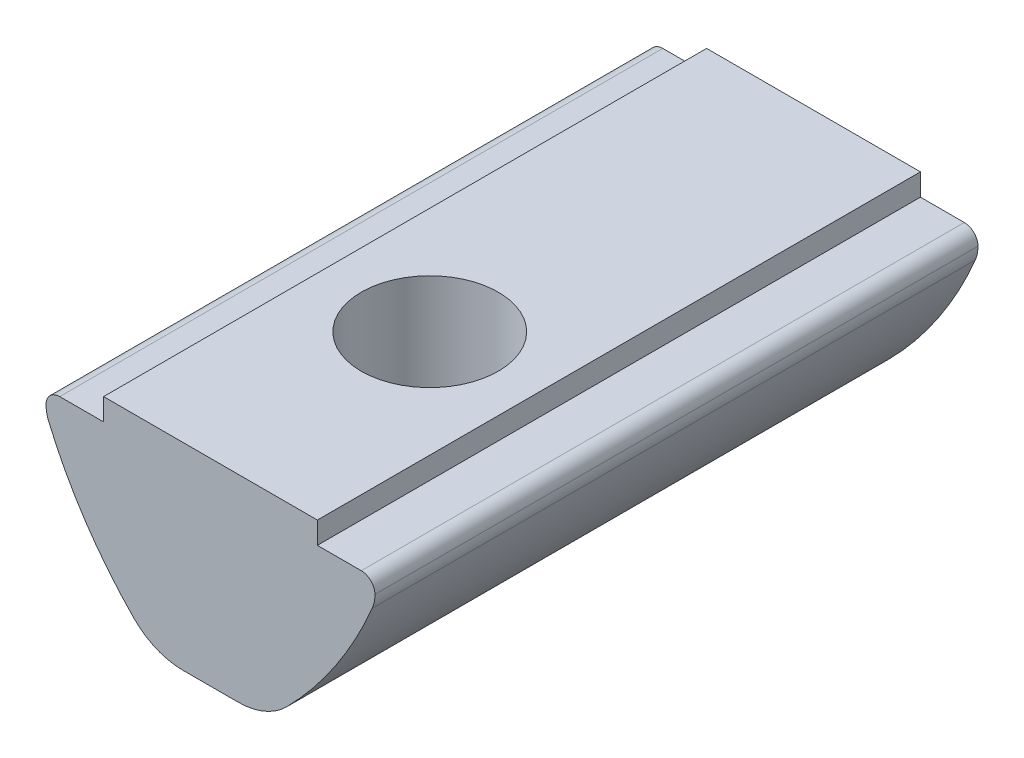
ISO-10303-21;
HEADER;
FILE_DESCRIPTION(('STEP AP214'),'2;1');
FILE_NAME('part.step','',(''),(''),'','','');
FILE_SCHEMA(('AUTOMOTIVE_DESIGN { 1 0 10303 214 1 1 1 1 }'));
ENDSEC;
DATA;
#1=APPLICATION_CONTEXT('core data for automotive mechanical design processes');
#2=APPLICATION_PROTOCOL_DEFINITION('international standard','automotive_design',2000,#1);
#3=PRODUCT_CONTEXT('',#1,'mechanical');
#4=PRODUCT('Part','Part','',(#3));
#5=PRODUCT_RELATED_PRODUCT_CATEGORY('part','',(#4));
#6=PRODUCT_DEFINITION_FORMATION('','',#4);
#7=PRODUCT_DEFINITION_CONTEXT('part definition',#1,'design');
#8=PRODUCT_DEFINITION('design','',#6,#7);
#9=PRODUCT_DEFINITION_SHAPE('','',#8);
#10=(LENGTH_UNIT() NAMED_UNIT(*) SI_UNIT(.MILLI.,.METRE.));
#11=(NAMED_UNIT(*) PLANE_ANGLE_UNIT() SI_UNIT($,.RADIAN.));
#12=(NAMED_UNIT(*) SI_UNIT($,.STERADIAN.) SOLID_ANGLE_UNIT());
#13=UNCERTAINTY_MEASURE_WITH_UNIT(LENGTH_MEASURE(1.E-05),#10,'distance_accuracy_value','');
#14=(GEOMETRIC_REPRESENTATION_CONTEXT(3) GLOBAL_UNCERTAINTY_ASSIGNED_CONTEXT((#13)) GLOBAL_UNIT_ASSIGNED_CONTEXT((#10,
#11,#12)) REPRESENTATION_CONTEXT('',''));
#15=CARTESIAN_POINT('',(0.,0.,0.));
#16=DIRECTION('',(0.,0.,1.));
#17=DIRECTION('',(1.,0.,0.));
#18=AXIS2_PLACEMENT_3D('',#15,#16,#17);
#19=CARTESIAN_POINT('',(-2.,-7.2,22.));
#20=DIRECTION('',(0.,1.,0.));
#21=DIRECTION('',(1.,0.,0.));
#22=AXIS2_PLACEMENT_3D('',#19,#20,#21);
#23=PLANE('',#22);
#24=CARTESIAN_POINT('',(0.,-7.2,14.));
#25=DIRECTION('',(0.,1.,0.));
#26=DIRECTION('',(-1.,0.,0.));
#27=AXIS2_PLACEMENT_3D('',#24,#25,#26);
#28=CIRCLE('',#27,2.5);
#29=CARTESIAN_POINT('',(-1.00631416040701,-7.2,16.2885217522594));
#30=VERTEX_POINT('',#29);
#31=CARTESIAN_POINT('',(1.00631416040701,-7.2,16.2885217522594));
#32=VERTEX_POINT('',#31);
#33=EDGE_CURVE('E656',#30,#32,#28,.T.);
#34=ORIENTED_EDGE('',*,*,#33,.T.);
#35=DIRECTION('',(0.,0.,1.));
#36=VECTOR('',#35,1.);
#37=CARTESIAN_POINT('',(1.00631416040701,-7.2,22.));
#38=LINE('',#37,#36);
#39=CARTESIAN_POINT('',(1.00631416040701,-7.2,22.));
#40=VERTEX_POINT('',#39);
#41=EDGE_CURVE('E69',#32,#40,#38,.T.);
#42=ORIENTED_EDGE('',*,*,#41,.T.);
#43=DIRECTION('',(1.,0.,0.));
#44=VECTOR('',#43,1.);
#45=CARTESIAN_POINT('',(-2.,-7.2,22.));
#46=LINE('',#45,#44);
#47=CARTESIAN_POINT('',(-1.00631416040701,-7.2,22.));
#48=VERTEX_POINT('',#47);
#49=EDGE_CURVE('E211',#48,#40,#46,.T.);
#50=ORIENTED_EDGE('',*,*,#49,.F.);
#51=DIRECTION('',(0.,0.,1.));
#52=VECTOR('',#51,1.);
#53=CARTESIAN_POINT('',(-1.00631416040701,-7.2,15.5));
#54=LINE('',#53,#52);
#55=EDGE_CURVE('E652',#48,#30,#54,.F.);
#56=ORIENTED_EDGE('',*,*,#55,.T.);
#57=EDGE_LOOP('',(#34,#42,#50,#56));
#58=FACE_BOUND('',#57,.T.);
#59=ADVANCED_FACE('F53',(#58),#23,.F.);
#60=CARTESIAN_POINT('',(0.,0.,0.));
#61=DIRECTION('',(0.,-1.,0.));
#62=DIRECTION('',(1.,0.,0.));
#63=AXIS2_PLACEMENT_3D('',#60,#61,#62);
#64=PLANE('',#63);
#65=DIRECTION('',(0.,0.,1.));
#66=VECTOR('',#65,1.);
#67=CARTESIAN_POINT('',(-3.89999999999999,0.,22.));
#68=LINE('',#67,#66);
#69=CARTESIAN_POINT('',(-3.9,0.,0.));
#70=VERTEX_POINT('',#69);
#71=CARTESIAN_POINT('',(-3.89999999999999,0.,22.));
#72=VERTEX_POINT('',#71);
#73=EDGE_CURVE('E194',#70,#72,#68,.T.);
#74=ORIENTED_EDGE('',*,*,#73,.T.);
#75=DIRECTION('',(1.,0.,0.));
#76=VECTOR('',#75,1.);
#77=CARTESIAN_POINT('',(3.9,0.,22.));
#78=LINE('',#77,#76);
#79=CARTESIAN_POINT('',(3.9,0.,22.));
#80=VERTEX_POINT('',#79);
#81=EDGE_CURVE('E182',#72,#80,#78,.T.);
#82=ORIENTED_EDGE('',*,*,#81,.T.);
#83=DIRECTION('',(0.,0.,-1.));
#84=VECTOR('',#83,1.);
#85=CARTESIAN_POINT('',(3.9,0.,0.));
#86=LINE('',#85,#84);
#87=CARTESIAN_POINT('',(3.9,0.,0.));
#88=VERTEX_POINT('',#87);
#89=EDGE_CURVE('E193',#80,#88,#86,.T.);
#90=ORIENTED_EDGE('',*,*,#89,.T.);
#91=DIRECTION('',(-1.,0.,0.));
#92=VECTOR('',#91,1.);
#93=CARTESIAN_POINT('',(-3.9,0.,0.));
#94=LINE('',#93,#92);
#95=EDGE_CURVE('E200',#88,#70,#94,.T.);
#96=ORIENTED_EDGE('',*,*,#95,.T.);
#97=EDGE_LOOP('',(#74,#82,#90,#96));
#98=FACE_BOUND('',#97,.T.);
#99=CARTESIAN_POINT('',(0.,0.,14.));
#100=DIRECTION('',(0.,1.,0.));
#101=DIRECTION('',(0.,0.,1.));
#102=AXIS2_PLACEMENT_3D('',#99,#100,#101);
#103=CIRCLE('',#102,2.5);
#104=CARTESIAN_POINT('',(0.,0.,16.5));
#105=VERTEX_POINT('',#104);
#106=EDGE_CURVE('E678',#105,#105,#103,.T.);
#107=ORIENTED_EDGE('',*,*,#106,.F.);
#108=EDGE_LOOP('',(#107));
#109=FACE_BOUND('',#108,.T.);
#110=ADVANCED_FACE('F197',(#98,#109),#64,.F.);
#111=CARTESIAN_POINT('',(1.00631416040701,-7.2,11.7114782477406));
#112=VERTEX_POINT('',#111);
#113=CARTESIAN_POINT('',(-1.00631416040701,-7.2,11.7114782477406));
#114=VERTEX_POINT('',#113);
#115=EDGE_CURVE('E663',#112,#114,#28,.T.);
#116=ORIENTED_EDGE('',*,*,#115,.T.);
#117=DIRECTION('',(0.,0.,1.));
#118=VECTOR('',#117,1.);
#119=CARTESIAN_POINT('',(-1.00631416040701,-7.2,6.49999999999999));
#120=LINE('',#119,#118);
#121=CARTESIAN_POINT('',(-1.00631416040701,-7.2,7.28852175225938));
#122=VERTEX_POINT('',#121);
#123=EDGE_CURVE('E668',#114,#122,#120,.F.);
#124=ORIENTED_EDGE('',*,*,#123,.T.);
#125=CARTESIAN_POINT('',(0.,-7.2,5.));
#126=DIRECTION('',(0.,-1.,0.));
#127=DIRECTION('',(1.,0.,0.));
#128=AXIS2_PLACEMENT_3D('',#125,#126,#127);
#129=CIRCLE('',#128,2.5);
#130=CARTESIAN_POINT('',(1.00631416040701,-7.2,7.28852175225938));
#131=VERTEX_POINT('',#130);
#132=EDGE_CURVE('E676',#131,#122,#129,.T.);
#133=ORIENTED_EDGE('',*,*,#132,.F.);
#134=DIRECTION('',(0.,0.,1.));
#135=VECTOR('',#134,1.);
#136=CARTESIAN_POINT('',(1.00631416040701,-7.2,12.5));
#137=LINE('',#136,#135);
#138=EDGE_CURVE('E672',#131,#112,#137,.T.);
#139=ORIENTED_EDGE('',*,*,#138,.T.);
#140=EDGE_LOOP('',(#116,#124,#133,#139));
#141=FACE_BOUND('',#140,.T.);
#142=ADVANCED_FACE('F675',(#141),#23,.F.);
#143=CARTESIAN_POINT('',(3.9,-0.8,22.));
#144=DIRECTION('',(0.,-1.,0.));
#145=DIRECTION('',(-1.,0.,0.));
#146=AXIS2_PLACEMENT_3D('',#143,#144,#145);
#147=PLANE('',#146);
#148=DIRECTION('',(-1.,0.,0.));
#149=VECTOR('',#148,1.);
#150=CARTESIAN_POINT('',(-3.9,-0.8,0.));
#151=LINE('',#150,#149);
#152=CARTESIAN_POINT('',(-3.9,-0.8,0.));
#153=VERTEX_POINT('',#152);
#154=CARTESIAN_POINT('',(-5.5,-0.8,0.));
#155=VERTEX_POINT('',#154);
#156=EDGE_CURVE('E523',#153,#155,#151,.T.);
#157=ORIENTED_EDGE('',*,*,#156,.T.);
#158=DIRECTION('',(0.,0.,1.));
#159=VECTOR('',#158,1.);
#160=CARTESIAN_POINT('',(-5.5,-0.799999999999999,22.));
#161=LINE('',#160,#159);
#162=CARTESIAN_POINT('',(-5.5,-0.8,22.));
#163=VERTEX_POINT('',#162);
#164=EDGE_CURVE('E574',#155,#163,#161,.T.);
#165=ORIENTED_EDGE('',*,*,#164,.T.);
#166=DIRECTION('',(-1.,0.,0.));
#167=VECTOR('',#166,1.);
#168=CARTESIAN_POINT('',(-3.9,-0.8,22.));
#169=LINE('',#168,#167);
#170=CARTESIAN_POINT('',(-3.9,-0.8,22.));
#171=VERTEX_POINT('',#170);
#172=EDGE_CURVE('E547',#171,#163,#169,.T.);
#173=ORIENTED_EDGE('',*,*,#172,.F.);
#174=DIRECTION('',(0.,0.,1.));
#175=VECTOR('',#174,1.);
#176=CARTESIAN_POINT('',(-3.89999999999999,-0.8,22.));
#177=LINE('',#176,#175);
#178=EDGE_CURVE('E207',#153,#171,#177,.T.);
#179=ORIENTED_EDGE('',*,*,#178,.F.);
#180=EDGE_LOOP('',(#157,#165,#173,#179));
#181=FACE_BOUND('',#180,.T.);
#182=ADVANCED_FACE('F573',(#181),#147,.F.);
#183=CARTESIAN_POINT('',(5.5,-0.799999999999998,22.));
#184=VERTEX_POINT('',#183);
#185=CARTESIAN_POINT('',(3.9,-0.799999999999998,22.));
#186=VERTEX_POINT('',#185);
#187=EDGE_CURVE('E543',#184,#186,#169,.T.);
#188=ORIENTED_EDGE('',*,*,#187,.F.);
#189=DIRECTION('',(0.,0.,1.));
#190=VECTOR('',#189,1.);
#191=CARTESIAN_POINT('',(5.5,-0.8,0.));
#192=LINE('',#191,#190);
#193=CARTESIAN_POINT('',(5.5,-0.799999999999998,0.));
#194=VERTEX_POINT('',#193);
#195=EDGE_CURVE('E591',#184,#194,#192,.F.);
#196=ORIENTED_EDGE('',*,*,#195,.T.);
#197=CARTESIAN_POINT('',(3.9,-0.8,0.));
#198=VERTEX_POINT('',#197);
#199=EDGE_CURVE('E372',#194,#198,#151,.T.);
#200=ORIENTED_EDGE('',*,*,#199,.T.);
#201=DIRECTION('',(0.,0.,-1.));
#202=VECTOR('',#201,1.);
#203=CARTESIAN_POINT('',(3.9,-0.8,0.));
#204=LINE('',#203,#202);
#205=EDGE_CURVE('E204',#186,#198,#204,.T.);
#206=ORIENTED_EDGE('',*,*,#205,.F.);
#207=EDGE_LOOP('',(#188,#196,#200,#206));
#208=FACE_BOUND('',#207,.T.);
#209=ADVANCED_FACE('F700',(#208),#147,.F.);
#210=CARTESIAN_POINT('',(-5.5,-1.3,0.));
#211=DIRECTION('',(0.,0.,1.));
#212=DIRECTION('',(1.,0.,0.));
#213=AXIS2_PLACEMENT_3D('',#210,#211,#212);
#214=PLANE('',#213);
#215=DIRECTION('',(1.,0.,0.));
#216=VECTOR('',#215,1.);
#217=CARTESIAN_POINT('',(-2.,-7.2,0.));
#218=LINE('',#217,#216);
#219=CARTESIAN_POINT('',(-1.00631416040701,-7.2,0.));
#220=VERTEX_POINT('',#219);
#221=CARTESIAN_POINT('',(1.00631416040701,-7.2,0.));
#222=VERTEX_POINT('',#221);
#223=EDGE_CURVE('E246',#220,#222,#218,.T.);
#224=ORIENTED_EDGE('',*,*,#223,.F.);
#225=CARTESIAN_POINT('',(-1.00631416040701,-4.7,0.));
#226=DIRECTION('',(0.,0.,1.));
#227=DIRECTION('',(1.,0.,0.));
#228=AXIS2_PLACEMENT_3D('',#225,#226,#227);
#229=CIRCLE('',#228,2.5);
#230=CARTESIAN_POINT('',(-2.79027251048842,-6.45142587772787,0.));
#231=VERTEX_POINT('',#230);
#232=EDGE_CURVE('E647',#220,#231,#229,.F.);
#233=ORIENTED_EDGE('',*,*,#232,.T.);
#234=CARTESIAN_POINT('',(7.91347759,4.05712938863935,0.));
#235=DIRECTION('',(0.,0.,1.));
#236=DIRECTION('',(1.,0.,0.));
#237=AXIS2_PLACEMENT_3D('',#234,#235,#236);
#238=CIRCLE('',#237,15.);
#239=CARTESIAN_POINT('',(-5.90122523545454,-1.78701176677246,0.));
#240=VERTEX_POINT('',#239);
#241=EDGE_CURVE('E240',#240,#231,#238,.T.);
#242=ORIENTED_EDGE('',*,*,#241,.F.);
#243=CARTESIAN_POINT('',(-4.75,-1.30000000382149,0.));
#244=DIRECTION('',(0.,0.,1.));
#245=DIRECTION('',(1.,0.,0.));
#246=AXIS2_PLACEMENT_3D('',#243,#244,#245);
#247=CIRCLE('',#246,1.25);
#248=CARTESIAN_POINT('',(-6.,-1.29999999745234,0.));
#249=VERTEX_POINT('',#248);
#250=EDGE_CURVE('E527',#249,#240,#247,.T.);
#251=ORIENTED_EDGE('',*,*,#250,.F.);
#252=CARTESIAN_POINT('',(-5.5,-1.3,0.));
#253=DIRECTION('',(0.,0.,1.));
#254=DIRECTION('',(1.,0.,0.));
#255=AXIS2_PLACEMENT_3D('',#252,#253,#254);
#256=CIRCLE('',#255,0.5);
#257=EDGE_CURVE('E579',#249,#155,#256,.F.);
#258=ORIENTED_EDGE('',*,*,#257,.T.);
#259=ORIENTED_EDGE('',*,*,#156,.F.);
#260=DIRECTION('',(0.,-1.,0.));
#261=VECTOR('',#260,1.);
#262=CARTESIAN_POINT('',(-3.9,0.,0.));
#263=LINE('',#262,#261);
#264=EDGE_CURVE('E690',#70,#153,#263,.T.);
#265=ORIENTED_EDGE('',*,*,#264,.F.);
#266=ORIENTED_EDGE('',*,*,#95,.F.);
#267=DIRECTION('',(0.,-1.,0.));
#268=VECTOR('',#267,1.);
#269=CARTESIAN_POINT('',(3.9,0.,0.));
#270=LINE('',#269,#268);
#271=EDGE_CURVE('E213',#88,#198,#270,.T.);
#272=ORIENTED_EDGE('',*,*,#271,.T.);
#273=ORIENTED_EDGE('',*,*,#199,.F.);
#274=CARTESIAN_POINT('',(5.5,-1.3,0.));
#275=DIRECTION('',(0.,0.,1.));
#276=DIRECTION('',(1.,0.,0.));
#277=AXIS2_PLACEMENT_3D('',#274,#275,#276);
#278=CIRCLE('',#277,0.5);
#279=CARTESIAN_POINT('',(6.,-1.29999999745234,0.));
#280=VERTEX_POINT('',#279);
#281=EDGE_CURVE('E553',#194,#280,#278,.F.);
#282=ORIENTED_EDGE('',*,*,#281,.T.);
#283=CARTESIAN_POINT('',(4.75,-1.30000000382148,0.));
#284=DIRECTION('',(0.,0.,1.));
#285=DIRECTION('',(-1.,0.,0.));
#286=AXIS2_PLACEMENT_3D('',#283,#284,#285);
#287=CIRCLE('',#286,1.25);
#288=CARTESIAN_POINT('',(5.90122523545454,-1.78701176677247,0.));
#289=VERTEX_POINT('',#288);
#290=EDGE_CURVE('E221',#289,#280,#287,.T.);
#291=ORIENTED_EDGE('',*,*,#290,.F.);
#292=CARTESIAN_POINT('',(-7.91347759,4.05712938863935,0.));
#293=DIRECTION('',(0.,0.,1.));
#294=DIRECTION('',(-1.,0.,0.));
#295=AXIS2_PLACEMENT_3D('',#292,#293,#294);
#296=CIRCLE('',#295,15.);
#297=CARTESIAN_POINT('',(2.79027251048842,-6.45142587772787,0.));
#298=VERTEX_POINT('',#297);
#299=EDGE_CURVE('E250',#298,#289,#296,.T.);
#300=ORIENTED_EDGE('',*,*,#299,.F.);
#301=CARTESIAN_POINT('',(1.00631416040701,-4.7,0.));
#302=DIRECTION('',(0.,0.,1.));
#303=DIRECTION('',(1.,0.,0.));
#304=AXIS2_PLACEMENT_3D('',#301,#302,#303);
#305=CIRCLE('',#304,2.5);
#306=EDGE_CURVE('E645',#298,#222,#305,.F.);
#307=ORIENTED_EDGE('',*,*,#306,.T.);
#308=EDGE_LOOP('',(#224,#233,#242,#251,#258,#259,#265,#266,#272,#273,#282,#291,#300,#307));
#309=FACE_BOUND('',#308,.T.);
#310=ADVANCED_FACE('F696',(#309),#214,.F.);
#311=CARTESIAN_POINT('',(-5.5,-1.3,22.));
#312=DIRECTION('',(0.,0.,1.));
#313=DIRECTION('',(1.,0.,0.));
#314=AXIS2_PLACEMENT_3D('',#311,#312,#313);
#315=PLANE('',#314);
#316=ORIENTED_EDGE('',*,*,#49,.T.);
#317=CARTESIAN_POINT('',(1.00631416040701,-4.7,22.));
#318=DIRECTION('',(0.,0.,1.));
#319=DIRECTION('',(1.,0.,0.));
#320=AXIS2_PLACEMENT_3D('',#317,#318,#319);
#321=CIRCLE('',#320,2.5);
#322=CARTESIAN_POINT('',(2.79027251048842,-6.45142587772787,22.));
#323=VERTEX_POINT('',#322);
#324=EDGE_CURVE('E13',#40,#323,#321,.T.);
#325=ORIENTED_EDGE('',*,*,#324,.T.);
#326=CARTESIAN_POINT('',(-7.91347759,4.05712938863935,22.));
#327=DIRECTION('',(0.,0.,1.));
#328=DIRECTION('',(-1.,0.,0.));
#329=AXIS2_PLACEMENT_3D('',#326,#327,#328);
#330=CIRCLE('',#329,15.);
#331=CARTESIAN_POINT('',(5.90122523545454,-1.78701176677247,22.));
#332=VERTEX_POINT('',#331);
#333=EDGE_CURVE('E217',#323,#332,#330,.T.);
#334=ORIENTED_EDGE('',*,*,#333,.T.);
#335=CARTESIAN_POINT('',(4.75,-1.30000000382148,22.));
#336=DIRECTION('',(0.,0.,1.));
#337=DIRECTION('',(-1.,0.,0.));
#338=AXIS2_PLACEMENT_3D('',#335,#336,#337);
#339=CIRCLE('',#338,1.25);
#340=CARTESIAN_POINT('',(6.,-1.29999999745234,22.));
#341=VERTEX_POINT('',#340);
#342=EDGE_CURVE('E519',#332,#341,#339,.T.);
#343=ORIENTED_EDGE('',*,*,#342,.T.);
#344=CARTESIAN_POINT('',(5.5,-1.3,22.));
#345=DIRECTION('',(0.,0.,1.));
#346=DIRECTION('',(1.,0.,0.));
#347=AXIS2_PLACEMENT_3D('',#344,#345,#346);
#348=CIRCLE('',#347,0.5);
#349=EDGE_CURVE('E581',#341,#184,#348,.T.);
#350=ORIENTED_EDGE('',*,*,#349,.T.);
#351=ORIENTED_EDGE('',*,*,#187,.T.);
#352=DIRECTION('',(0.,-1.,0.));
#353=VECTOR('',#352,1.);
#354=CARTESIAN_POINT('',(3.9,0.,22.));
#355=LINE('',#354,#353);
#356=EDGE_CURVE('E190',#80,#186,#355,.T.);
#357=ORIENTED_EDGE('',*,*,#356,.F.);
#358=ORIENTED_EDGE('',*,*,#81,.F.);
#359=DIRECTION('',(0.,-1.,0.));
#360=VECTOR('',#359,1.);
#361=CARTESIAN_POINT('',(-3.89999999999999,0.,22.));
#362=LINE('',#361,#360);
#363=EDGE_CURVE('E187',#72,#171,#362,.T.);
#364=ORIENTED_EDGE('',*,*,#363,.T.);
#365=ORIENTED_EDGE('',*,*,#172,.T.);
#366=CARTESIAN_POINT('',(-5.5,-1.3,22.));
#367=DIRECTION('',(0.,0.,1.));
#368=DIRECTION('',(1.,0.,0.));
#369=AXIS2_PLACEMENT_3D('',#366,#367,#368);
#370=CIRCLE('',#369,0.5);
#371=CARTESIAN_POINT('',(-6.,-1.29999999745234,22.));
#372=VERTEX_POINT('',#371);
#373=EDGE_CURVE('E580',#163,#372,#370,.T.);
#374=ORIENTED_EDGE('',*,*,#373,.T.);
#375=CARTESIAN_POINT('',(-4.75,-1.30000000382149,22.));
#376=DIRECTION('',(0.,0.,1.));
#377=DIRECTION('',(1.,0.,0.));
#378=AXIS2_PLACEMENT_3D('',#375,#376,#377);
#379=CIRCLE('',#378,1.25);
#380=CARTESIAN_POINT('',(-5.90122523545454,-1.78701176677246,22.));
#381=VERTEX_POINT('',#380);
#382=EDGE_CURVE('E370',#372,#381,#379,.T.);
#383=ORIENTED_EDGE('',*,*,#382,.T.);
#384=CARTESIAN_POINT('',(7.91347759,4.05712938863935,22.));
#385=DIRECTION('',(0.,0.,1.));
#386=DIRECTION('',(1.,0.,0.));
#387=AXIS2_PLACEMENT_3D('',#384,#385,#386);
#388=CIRCLE('',#387,15.);
#389=CARTESIAN_POINT('',(-2.79027251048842,-6.45142587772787,22.));
#390=VERTEX_POINT('',#389);
#391=EDGE_CURVE('E247',#381,#390,#388,.T.);
#392=ORIENTED_EDGE('',*,*,#391,.T.);
#393=CARTESIAN_POINT('',(-1.00631416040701,-4.7,22.));
#394=DIRECTION('',(0.,0.,1.));
#395=DIRECTION('',(1.,0.,0.));
#396=AXIS2_PLACEMENT_3D('',#393,#394,#395);
#397=CIRCLE('',#396,2.5);
#398=EDGE_CURVE('E62',#390,#48,#397,.T.);
#399=ORIENTED_EDGE('',*,*,#398,.T.);
#400=EDGE_LOOP('',(#316,#325,#334,#343,#350,#351,#357,#358,#364,#365,#374,#383,#392,#399));
#401=FACE_BOUND('',#400,.T.);
#402=ADVANCED_FACE('F184',(#401),#315,.T.);
#403=CARTESIAN_POINT('',(4.75,-1.30000000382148,22.));
#404=DIRECTION('',(0.,0.,-1.));
#405=DIRECTION('',(-1.,0.,0.));
#406=AXIS2_PLACEMENT_3D('',#403,#404,#405);
#407=CYLINDRICAL_SURFACE('',#406,1.25);
#408=ORIENTED_EDGE('',*,*,#290,.T.);
#409=DIRECTION('',(0.,0.,-1.));
#410=VECTOR('',#409,1.);
#411=CARTESIAN_POINT('',(6.,-1.29999999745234,22.));
#412=LINE('',#411,#410);
#413=EDGE_CURVE('E588',#280,#341,#412,.F.);
#414=ORIENTED_EDGE('',*,*,#413,.T.);
#415=ORIENTED_EDGE('',*,*,#342,.F.);
#416=DIRECTION('',(0.,0.,-1.));
#417=VECTOR('',#416,1.);
#418=CARTESIAN_POINT('',(5.90122523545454,-1.78701176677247,22.));
#419=LINE('',#418,#417);
#420=EDGE_CURVE('E222',#332,#289,#419,.T.);
#421=ORIENTED_EDGE('',*,*,#420,.T.);
#422=EDGE_LOOP('',(#408,#414,#415,#421));
#423=FACE_BOUND('',#422,.T.);
#424=ADVANCED_FACE('F756',(#423),#407,.T.);
#425=CARTESIAN_POINT('',(-7.91347759,4.05712938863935,22.));
#426=DIRECTION('',(0.,0.,-1.));
#427=DIRECTION('',(-1.,0.,0.));
#428=AXIS2_PLACEMENT_3D('',#425,#426,#427);
#429=CYLINDRICAL_SURFACE('',#428,15.);
#430=DIRECTION('',(0.,0.,-1.));
#431=VECTOR('',#430,1.);
#432=CARTESIAN_POINT('',(2.79027251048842,-6.45142587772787,22.));
#433=LINE('',#432,#431);
#434=EDGE_CURVE('E650',#323,#298,#433,.T.);
#435=ORIENTED_EDGE('',*,*,#434,.T.);
#436=ORIENTED_EDGE('',*,*,#299,.T.);
#437=ORIENTED_EDGE('',*,*,#420,.F.);
#438=ORIENTED_EDGE('',*,*,#333,.F.);
#439=EDGE_LOOP('',(#435,#436,#437,#438));
#440=FACE_BOUND('',#439,.T.);
#441=ADVANCED_FACE('F758',(#440),#429,.T.);
#442=CARTESIAN_POINT('',(7.91347759,4.05712938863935,22.));
#443=DIRECTION('',(0.,0.,-1.));
#444=DIRECTION('',(-1.,0.,0.));
#445=AXIS2_PLACEMENT_3D('',#442,#443,#444);
#446=CYLINDRICAL_SURFACE('',#445,15.);
#447=ORIENTED_EDGE('',*,*,#241,.T.);
#448=DIRECTION('',(0.,0.,-1.));
#449=VECTOR('',#448,1.);
#450=CARTESIAN_POINT('',(-2.79027251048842,-6.45142587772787,22.));
#451=LINE('',#450,#449);
#452=EDGE_CURVE('E593',#231,#390,#451,.F.);
#453=ORIENTED_EDGE('',*,*,#452,.T.);
#454=ORIENTED_EDGE('',*,*,#391,.F.);
#455=DIRECTION('',(0.,0.,-1.));
#456=VECTOR('',#455,1.);
#457=CARTESIAN_POINT('',(-5.90122523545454,-1.78701176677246,22.));
#458=LINE('',#457,#456);
#459=EDGE_CURVE('E248',#381,#240,#458,.T.);
#460=ORIENTED_EDGE('',*,*,#459,.T.);
#461=EDGE_LOOP('',(#447,#453,#454,#460));
#462=FACE_BOUND('',#461,.T.);
#463=ADVANCED_FACE('F731',(#462),#446,.T.);
#464=CARTESIAN_POINT('',(-4.75,-1.30000000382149,22.));
#465=DIRECTION('',(0.,0.,-1.));
#466=DIRECTION('',(-1.,0.,0.));
#467=AXIS2_PLACEMENT_3D('',#464,#465,#466);
#468=CYLINDRICAL_SURFACE('',#467,1.25);
#469=ORIENTED_EDGE('',*,*,#382,.F.);
#470=DIRECTION('',(0.,0.,-1.));
#471=VECTOR('',#470,1.);
#472=CARTESIAN_POINT('',(-6.,-1.29999999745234,22.));
#473=LINE('',#472,#471);
#474=EDGE_CURVE('E546',#372,#249,#473,.T.);
#475=ORIENTED_EDGE('',*,*,#474,.T.);
#476=ORIENTED_EDGE('',*,*,#250,.T.);
#477=ORIENTED_EDGE('',*,*,#459,.F.);
#478=EDGE_LOOP('',(#469,#475,#476,#477));
#479=FACE_BOUND('',#478,.T.);
#480=ADVANCED_FACE('F734',(#479),#468,.T.);
#481=CARTESIAN_POINT('',(-1.00631416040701,-7.2,2.71147824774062));
#482=VERTEX_POINT('',#481);
#483=CARTESIAN_POINT('',(1.00631416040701,-7.2,2.71147824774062));
#484=VERTEX_POINT('',#483);
#485=EDGE_CURVE('E662',#482,#484,#129,.T.);
#486=ORIENTED_EDGE('',*,*,#485,.F.);
#487=DIRECTION('',(0.,0.,1.));
#488=VECTOR('',#487,1.);
#489=CARTESIAN_POINT('',(-1.00631416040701,-7.2,0.));
#490=LINE('',#489,#488);
#491=EDGE_CURVE('E643',#482,#220,#490,.F.);
#492=ORIENTED_EDGE('',*,*,#491,.T.);
#493=ORIENTED_EDGE('',*,*,#223,.T.);
#494=DIRECTION('',(0.,0.,1.));
#495=VECTOR('',#494,1.);
#496=CARTESIAN_POINT('',(1.00631416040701,-7.2,3.5));
#497=LINE('',#496,#495);
#498=EDGE_CURVE('E640',#222,#484,#497,.T.);
#499=ORIENTED_EDGE('',*,*,#498,.T.);
#500=EDGE_LOOP('',(#486,#492,#493,#499));
#501=FACE_BOUND('',#500,.T.);
#502=ADVANCED_FACE('F739',(#501),#23,.F.);
#503=CARTESIAN_POINT('',(3.9,0.,0.));
#504=DIRECTION('',(-1.,0.,0.));
#505=DIRECTION('',(0.,-1.,0.));
#506=AXIS2_PLACEMENT_3D('',#503,#504,#505);
#507=PLANE('',#506);
#508=ORIENTED_EDGE('',*,*,#205,.T.);
#509=ORIENTED_EDGE('',*,*,#271,.F.);
#510=ORIENTED_EDGE('',*,*,#89,.F.);
#511=ORIENTED_EDGE('',*,*,#356,.T.);
#512=EDGE_LOOP('',(#508,#509,#510,#511));
#513=FACE_BOUND('',#512,.T.);
#514=ADVANCED_FACE('F699',(#513),#507,.F.);
#515=CARTESIAN_POINT('',(-3.89999999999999,0.,22.));
#516=DIRECTION('',(1.,0.,0.));
#517=DIRECTION('',(0.,0.,-1.));
#518=AXIS2_PLACEMENT_3D('',#515,#516,#517);
#519=PLANE('',#518);
#520=ORIENTED_EDGE('',*,*,#178,.T.);
#521=ORIENTED_EDGE('',*,*,#363,.F.);
#522=ORIENTED_EDGE('',*,*,#73,.F.);
#523=ORIENTED_EDGE('',*,*,#264,.T.);
#524=EDGE_LOOP('',(#520,#521,#522,#523));
#525=FACE_BOUND('',#524,.T.);
#526=ADVANCED_FACE('F206',(#525),#519,.F.);
#527=CARTESIAN_POINT('',(0.,-1.20000000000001,5.));
#528=DIRECTION('',(0.,-1.,0.));
#529=DIRECTION('',(1.,0.,0.));
#530=AXIS2_PLACEMENT_3D('',#527,#528,#529);
#531=CYLINDRICAL_SURFACE('',#530,2.5);
#532=ORIENTED_EDGE('',*,*,#132,.T.);
#533=CARTESIAN_POINT('',(-1.00631416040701,-7.2,7.28852175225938));
#534=CARTESIAN_POINT('',(-1.06565415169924,-7.20001041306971,7.26244410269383));
#535=CARTESIAN_POINT('',(-1.12393286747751,-7.19788807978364,7.23404923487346));
#536=CARTESIAN_POINT('',(-1.23784434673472,-7.18990653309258,7.17299154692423));
#537=CARTESIAN_POINT('',(-1.29348069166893,-7.18405254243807,7.14033474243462));
#538=CARTESIAN_POINT('',(-1.40129350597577,-7.16919660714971,7.07133858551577));
#539=CARTESIAN_POINT('',(-1.453495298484,-7.16022175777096,7.0350327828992));
#540=CARTESIAN_POINT('',(-1.55466773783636,-7.13966708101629,6.95883190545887));
#541=CARTESIAN_POINT('',(-1.60363729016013,-7.12808637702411,6.91893562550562));
#542=CARTESIAN_POINT('',(-1.7448364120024,-7.09040299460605,6.7947655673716));
#543=CARTESIAN_POINT('',(-1.83201662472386,-7.0612553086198,6.70558419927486));
#544=CARTESIAN_POINT('',(-1.99187997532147,-6.99914246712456,6.51587745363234));
#545=CARTESIAN_POINT('',(-2.06451412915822,-6.96616498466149,6.41531547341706));
#546=CARTESIAN_POINT('',(-2.20304822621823,-6.89649838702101,6.19010032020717));
#547=CARTESIAN_POINT('',(-2.26671298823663,-6.85990967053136,6.06402784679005));
#548=CARTESIAN_POINT('',(-2.37231367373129,-6.79473856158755,5.80129570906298));
#549=CARTESIAN_POINT('',(-2.41429787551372,-6.76613844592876,5.66466035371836));
#550=CARTESIAN_POINT('',(-2.46835326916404,-6.72812855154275,5.41264164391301));
#551=CARTESIAN_POINT('',(-2.48478151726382,-6.71599297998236,5.29861454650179));
#552=CARTESIAN_POINT('',(-2.50170212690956,-6.70348266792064,5.06878294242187));
#553=CARTESIAN_POINT('',(-2.50220901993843,-6.70309720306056,4.95298015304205));
#554=CARTESIAN_POINT('',(-2.48729076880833,-6.714145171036,4.72314974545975));
#555=CARTESIAN_POINT('',(-2.4718824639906,-6.72556611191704,4.60912038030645));
#556=CARTESIAN_POINT('',(-2.42600055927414,-6.75797466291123,4.38552299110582));
#557=CARTESIAN_POINT('',(-2.39551110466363,-6.7789723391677,4.27595979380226));
#558=CARTESIAN_POINT('',(-2.31837814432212,-6.82854414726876,4.0569187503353));
#559=CARTESIAN_POINT('',(-2.27088655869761,-6.85749265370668,3.94782849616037));
#560=CARTESIAN_POINT('',(-2.16130203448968,-6.91809051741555,3.73793203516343));
#561=CARTESIAN_POINT('',(-2.09918932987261,-6.9497434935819,3.6371372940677));
#562=CARTESIAN_POINT('',(-1.94719306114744,-7.0179779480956,3.42562580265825));
#563=CARTESIAN_POINT('',(-1.85423563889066,-7.05426749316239,3.31700165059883));
#564=CARTESIAN_POINT('',(-1.64975393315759,-7.11813671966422,3.11619897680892));
#565=CARTESIAN_POINT('',(-1.53829031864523,-7.14574403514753,3.02396869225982));
#566=CARTESIAN_POINT('',(-1.35436269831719,-7.1765174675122,2.89718269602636));
#567=CARTESIAN_POINT('',(-1.28756428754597,-7.18508452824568,2.85562104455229));
#568=CARTESIAN_POINT('',(-1.14983655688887,-7.19683964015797,2.77870864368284));
#569=CARTESIAN_POINT('',(-1.07889771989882,-7.20001474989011,2.74337301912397));
#570=CARTESIAN_POINT('',(-1.00631416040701,-7.2,2.71147824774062));
#571=B_SPLINE_CURVE_WITH_KNOTS('',3,(#533,#534,#535,#536,#537,#538,#539,#540,#541,#542,#543,
#544,#545,#546,#547,#548,#549,#550,#551,#552,#553,#554,#555,#556,#557,#558,#559,#560,#561,#562,
#563,#564,#565,#566,#567,#568,#569,#570),.UNSPECIFIED.,.F.,.F.,(4,2,2,2,2,2,2,2,2,2,2,2,2,2,2,2,
2,2,4),(0.,0.194309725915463,0.388348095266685,0.580742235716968,0.773201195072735,
1.15576973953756,1.53960569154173,1.97529307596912,2.41000604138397,2.7559689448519,
3.1016160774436,3.446897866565,3.79254342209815,4.15861303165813,4.52518039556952,
4.96560379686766,5.40461087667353,5.64153858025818,5.87903414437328),.UNSPECIFIED.);
#572=EDGE_CURVE('E634',#122,#482,#571,.T.);
#573=ORIENTED_EDGE('',*,*,#572,.T.);
#574=ORIENTED_EDGE('',*,*,#485,.T.);
#575=CARTESIAN_POINT('',(1.00631416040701,-7.2,2.71147824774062));
#576=CARTESIAN_POINT('',(1.06565415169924,-7.20001041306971,2.73755589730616));
#577=CARTESIAN_POINT('',(1.12393286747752,-7.19788807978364,2.76595076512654));
#578=CARTESIAN_POINT('',(1.23784434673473,-7.18990653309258,2.82700845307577));
#579=CARTESIAN_POINT('',(1.29348069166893,-7.18405254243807,2.85966525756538));
#580=CARTESIAN_POINT('',(1.40129350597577,-7.16919660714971,2.92866141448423));
#581=CARTESIAN_POINT('',(1.453495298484,-7.16022175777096,2.9649672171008));
#582=CARTESIAN_POINT('',(1.55466773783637,-7.13966708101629,3.04116809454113));
#583=CARTESIAN_POINT('',(1.60363729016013,-7.12808637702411,3.08106437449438));
#584=CARTESIAN_POINT('',(1.74483641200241,-7.09040299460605,3.20523443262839));
#585=CARTESIAN_POINT('',(1.83201662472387,-7.0612553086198,3.29441580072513));
#586=CARTESIAN_POINT('',(1.99187997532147,-6.99914246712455,3.48412254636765));
#587=CARTESIAN_POINT('',(2.06451412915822,-6.96616498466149,3.58468452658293));
#588=CARTESIAN_POINT('',(2.20304822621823,-6.89649838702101,3.80989967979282));
#589=CARTESIAN_POINT('',(2.26671298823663,-6.85990967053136,3.93597215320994));
#590=CARTESIAN_POINT('',(2.37231367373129,-6.79473856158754,4.19870429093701));
#591=CARTESIAN_POINT('',(2.41429787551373,-6.76613844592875,4.33533964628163));
#592=CARTESIAN_POINT('',(2.46835326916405,-6.72812855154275,4.58735835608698));
#593=CARTESIAN_POINT('',(2.48478151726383,-6.71599297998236,4.70138545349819));
#594=CARTESIAN_POINT('',(2.50170212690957,-6.70348266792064,4.93121705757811));
#595=CARTESIAN_POINT('',(2.50220901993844,-6.70309720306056,5.04701984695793));
#596=CARTESIAN_POINT('',(2.48729076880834,-6.71414517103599,5.27685025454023));
#597=CARTESIAN_POINT('',(2.47188246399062,-6.72556611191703,5.39087961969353));
#598=CARTESIAN_POINT('',(2.42600055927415,-6.75797466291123,5.61447700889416));
#599=CARTESIAN_POINT('',(2.39551110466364,-6.77897233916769,5.72404020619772));
#600=CARTESIAN_POINT('',(2.31837814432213,-6.82854414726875,5.94308124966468));
#601=CARTESIAN_POINT('',(2.27088655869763,-6.85749265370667,6.05217150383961));
#602=CARTESIAN_POINT('',(2.1613020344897,-6.91809051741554,6.26206796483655));
#603=CARTESIAN_POINT('',(2.09918932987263,-6.94974349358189,6.36286270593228));
#604=CARTESIAN_POINT('',(1.94719306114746,-7.01797794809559,6.57437419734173));
#605=CARTESIAN_POINT('',(1.85423563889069,-7.05426749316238,6.68299834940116));
#606=CARTESIAN_POINT('',(1.64975393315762,-7.11813671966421,6.88380102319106));
#607=CARTESIAN_POINT('',(1.53829031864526,-7.14574403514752,6.97603130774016));
#608=CARTESIAN_POINT('',(1.35436269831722,-7.1765174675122,7.10281730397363));
#609=CARTESIAN_POINT('',(1.28756428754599,-7.18508452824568,7.14437895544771));
#610=CARTESIAN_POINT('',(1.14983655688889,-7.19683964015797,7.22129135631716));
#611=CARTESIAN_POINT('',(1.07889771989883,-7.20001474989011,7.25662698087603));
#612=CARTESIAN_POINT('',(1.00631416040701,-7.2,7.28852175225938));
#613=B_SPLINE_CURVE_WITH_KNOTS('',3,(#575,#576,#577,#578,#579,#580,#581,#582,#583,#584,#585,
#586,#587,#588,#589,#590,#591,#592,#593,#594,#595,#596,#597,#598,#599,#600,#601,#602,#603,#604,
#605,#606,#607,#608,#609,#610,#611,#612),.UNSPECIFIED.,.F.,.F.,(4,2,2,2,2,2,2,2,2,2,2,2,2,2,2,2,
2,2,4),(0.,0.194309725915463,0.388348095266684,0.580742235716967,0.773201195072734,
1.15576973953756,1.53960569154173,1.97529307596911,2.41000604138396,2.75596894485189,
3.10161607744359,3.44689786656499,3.79254342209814,4.15861303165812,4.52518039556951,
4.96560379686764,5.40461087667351,5.64153858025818,5.8790341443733),.UNSPECIFIED.);
#614=EDGE_CURVE('E627',#484,#131,#613,.T.);
#615=ORIENTED_EDGE('',*,*,#614,.T.);
#616=EDGE_LOOP('',(#532,#573,#574,#615));
#617=FACE_BOUND('',#616,.T.);
#618=CARTESIAN_POINT('',(0.,-1.20000000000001,5.));
#619=DIRECTION('',(0.,-1.,0.));
#620=DIRECTION('',(1.,0.,0.));
#621=AXIS2_PLACEMENT_3D('',#618,#619,#620);
#622=CIRCLE('',#621,2.5);
#623=CARTESIAN_POINT('',(2.5,-1.20000000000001,5.));
#624=VERTEX_POINT('',#623);
#625=EDGE_CURVE('E684',#624,#624,#622,.T.);
#626=ORIENTED_EDGE('',*,*,#625,.F.);
#627=EDGE_LOOP('',(#626));
#628=FACE_BOUND('',#627,.T.);
#629=ADVANCED_FACE('F617',(#617,#628),#531,.F.);
#630=CARTESIAN_POINT('',(0.,-0.3,5.));
#631=DIRECTION('',(0.,-1.,0.));
#632=DIRECTION('',(1.,0.,0.));
#633=AXIS2_PLACEMENT_3D('',#630,#631,#632);
#634=CONICAL_SURFACE('',#633,0.0272703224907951,1.22173047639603);
#635=CARTESIAN_POINT('',(0.,-0.799999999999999,5.));
#636=DIRECTION('',(0.,-1.,0.));
#637=DIRECTION('',(1.,0.,0.));
#638=AXIS2_PLACEMENT_3D('',#635,#636,#637);
#639=CIRCLE('',#638,1.4010090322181);
#640=CARTESIAN_POINT('',(1.40100903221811,-0.799999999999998,5.));
#641=VERTEX_POINT('',#640);
#642=EDGE_CURVE('E208',#641,#641,#639,.F.);
#643=ORIENTED_EDGE('',*,*,#642,.T.);
#644=EDGE_LOOP('',(#643));
#645=FACE_BOUND('',#644,.T.);
#646=ORIENTED_EDGE('',*,*,#625,.T.);
#647=EDGE_LOOP('',(#646));
#648=FACE_BOUND('',#647,.T.);
#649=ADVANCED_FACE('F622',(#645,#648),#634,.F.);
#650=CARTESIAN_POINT('',(0.,-0.8,0.));
#651=DIRECTION('',(0.,-1.,0.));
#652=DIRECTION('',(1.,0.,0.));
#653=AXIS2_PLACEMENT_3D('',#650,#651,#652);
#654=PLANE('',#653);
#655=ORIENTED_EDGE('',*,*,#642,.F.);
#656=EDGE_LOOP('',(#655));
#657=FACE_BOUND('',#656,.T.);
#658=ADVANCED_FACE('F615',(#657),#654,.T.);
#659=CARTESIAN_POINT('',(0.,0.,14.));
#660=DIRECTION('',(0.,1.,0.));
#661=DIRECTION('',(0.,0.,1.));
#662=AXIS2_PLACEMENT_3D('',#659,#660,#661);
#663=CYLINDRICAL_SURFACE('',#662,2.5);
#664=ORIENTED_EDGE('',*,*,#115,.F.);
#665=CARTESIAN_POINT('',(1.00631416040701,-7.2,11.7114782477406));
#666=CARTESIAN_POINT('',(1.06565415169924,-7.20001041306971,11.7375558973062));
#667=CARTESIAN_POINT('',(1.12393286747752,-7.19788807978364,11.7659507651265));
#668=CARTESIAN_POINT('',(1.23784434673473,-7.18990653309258,11.8270084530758));
#669=CARTESIAN_POINT('',(1.29348069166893,-7.18405254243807,11.8596652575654));
#670=CARTESIAN_POINT('',(1.40129350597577,-7.16919660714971,11.9286614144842));
#671=CARTESIAN_POINT('',(1.453495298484,-7.16022175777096,11.9649672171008));
#672=CARTESIAN_POINT('',(1.55466773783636,-7.13966708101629,12.0411680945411));
#673=CARTESIAN_POINT('',(1.60363729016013,-7.12808637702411,12.0810643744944));
#674=CARTESIAN_POINT('',(1.7448364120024,-7.09040299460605,12.2052344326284));
#675=CARTESIAN_POINT('',(1.83201662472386,-7.0612553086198,12.2944158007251));
#676=CARTESIAN_POINT('',(1.99187997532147,-6.99914246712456,12.4841225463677));
#677=CARTESIAN_POINT('',(2.06451412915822,-6.96616498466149,12.5846845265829));
#678=CARTESIAN_POINT('',(2.20304822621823,-6.89649838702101,12.8098996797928));
#679=CARTESIAN_POINT('',(2.26671298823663,-6.85990967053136,12.9359721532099));
#680=CARTESIAN_POINT('',(2.37231367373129,-6.79473856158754,13.198704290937));
#681=CARTESIAN_POINT('',(2.41429787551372,-6.76613844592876,13.3353396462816));
#682=CARTESIAN_POINT('',(2.46835326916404,-6.72812855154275,13.587358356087));
#683=CARTESIAN_POINT('',(2.48478151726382,-6.71599297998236,13.7013854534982));
#684=CARTESIAN_POINT('',(2.50170212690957,-6.70348266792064,13.9312170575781));
#685=CARTESIAN_POINT('',(2.50220901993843,-6.70309720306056,14.0470198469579));
#686=CARTESIAN_POINT('',(2.48729076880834,-6.714145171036,14.2768502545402));
#687=CARTESIAN_POINT('',(2.47188246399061,-6.72556611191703,14.3908796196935));
#688=CARTESIAN_POINT('',(2.42600055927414,-6.75797466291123,14.6144770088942));
#689=CARTESIAN_POINT('',(2.39551110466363,-6.7789723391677,14.7240402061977));
#690=CARTESIAN_POINT('',(2.31837814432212,-6.82854414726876,14.9430812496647));
#691=CARTESIAN_POINT('',(2.27088655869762,-6.85749265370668,15.0521715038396));
#692=CARTESIAN_POINT('',(2.16130203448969,-6.91809051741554,15.2620679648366));
#693=CARTESIAN_POINT('',(2.09918932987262,-6.9497434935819,15.3628627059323));
#694=CARTESIAN_POINT('',(1.94719306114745,-7.0179779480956,15.5743741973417));
#695=CARTESIAN_POINT('',(1.85423563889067,-7.05426749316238,15.6829983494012));
#696=CARTESIAN_POINT('',(1.6497539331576,-7.11813671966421,15.8838010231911));
#697=CARTESIAN_POINT('',(1.53829031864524,-7.14574403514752,15.9760313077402));
#698=CARTESIAN_POINT('',(1.3543626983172,-7.1765174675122,16.1028173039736));
#699=CARTESIAN_POINT('',(1.28756428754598,-7.18508452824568,16.1443789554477));
#700=CARTESIAN_POINT('',(1.14983655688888,-7.19683964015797,16.2212913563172));
#701=CARTESIAN_POINT('',(1.07889771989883,-7.20001474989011,16.256626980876));
#702=CARTESIAN_POINT('',(1.00631416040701,-7.2,16.2885217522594));
#703=B_SPLINE_CURVE_WITH_KNOTS('',3,(#665,#666,#667,#668,#669,#670,#671,#672,#673,#674,#675,
#676,#677,#678,#679,#680,#681,#682,#683,#684,#685,#686,#687,#688,#689,#690,#691,#692,#693,#694,
#695,#696,#697,#698,#699,#700,#701,#702),.UNSPECIFIED.,.F.,.F.,(4,2,2,2,2,2,2,2,2,2,2,2,2,2,2,2,
2,2,4),(0.,0.194309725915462,0.388348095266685,0.580742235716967,0.773201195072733,
1.15576973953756,1.53960569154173,1.97529307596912,2.41000604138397,2.7559689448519,
3.1016160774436,3.446897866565,3.79254342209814,4.15861303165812,4.52518039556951,
4.96560379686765,5.40461087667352,5.64153858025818,5.87903414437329),.UNSPECIFIED.);
#704=EDGE_CURVE('E602',#112,#32,#703,.T.);
#705=ORIENTED_EDGE('',*,*,#704,.T.);
#706=ORIENTED_EDGE('',*,*,#33,.F.);
#707=CARTESIAN_POINT('',(-1.00631416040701,-7.2,16.2885217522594));
#708=CARTESIAN_POINT('',(-1.06565415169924,-7.20001041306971,16.2624441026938));
#709=CARTESIAN_POINT('',(-1.12393286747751,-7.19788807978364,16.2340492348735));
#710=CARTESIAN_POINT('',(-1.23784434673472,-7.18990653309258,16.1729915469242));
#711=CARTESIAN_POINT('',(-1.29348069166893,-7.18405254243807,16.1403347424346));
#712=CARTESIAN_POINT('',(-1.40129350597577,-7.16919660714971,16.0713385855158));
#713=CARTESIAN_POINT('',(-1.453495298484,-7.16022175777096,16.0350327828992));
#714=CARTESIAN_POINT('',(-1.55466773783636,-7.13966708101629,15.9588319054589));
#715=CARTESIAN_POINT('',(-1.60363729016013,-7.12808637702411,15.9189356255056));
#716=CARTESIAN_POINT('',(-1.7448364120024,-7.09040299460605,15.7947655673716));
#717=CARTESIAN_POINT('',(-1.83201662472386,-7.0612553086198,15.7055841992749));
#718=CARTESIAN_POINT('',(-1.99187997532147,-6.99914246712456,15.5158774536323));
#719=CARTESIAN_POINT('',(-2.06451412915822,-6.96616498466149,15.4153154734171));
#720=CARTESIAN_POINT('',(-2.20304822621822,-6.89649838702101,15.1901003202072));
#721=CARTESIAN_POINT('',(-2.26671298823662,-6.85990967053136,15.0640278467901));
#722=CARTESIAN_POINT('',(-2.37231367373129,-6.79473856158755,14.801295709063));
#723=CARTESIAN_POINT('',(-2.41429787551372,-6.76613844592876,14.6646603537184));
#724=CARTESIAN_POINT('',(-2.46835326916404,-6.72812855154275,14.412641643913));
#725=CARTESIAN_POINT('',(-2.48478151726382,-6.71599297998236,14.2986145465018));
#726=CARTESIAN_POINT('',(-2.50170212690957,-6.70348266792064,14.0687829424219));
#727=CARTESIAN_POINT('',(-2.50220901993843,-6.70309720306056,13.9529801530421));
#728=CARTESIAN_POINT('',(-2.48729076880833,-6.714145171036,13.7231497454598));
#729=CARTESIAN_POINT('',(-2.47188246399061,-6.72556611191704,13.6091203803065));
#730=CARTESIAN_POINT('',(-2.42600055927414,-6.75797466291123,13.3855229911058));
#731=CARTESIAN_POINT('',(-2.39551110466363,-6.7789723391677,13.2759597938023));
#732=CARTESIAN_POINT('',(-2.31837814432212,-6.82854414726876,13.0569187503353));
#733=CARTESIAN_POINT('',(-2.27088655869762,-6.85749265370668,12.9478284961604));
#734=CARTESIAN_POINT('',(-2.16130203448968,-6.91809051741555,12.7379320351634));
#735=CARTESIAN_POINT('',(-2.09918932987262,-6.9497434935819,12.6371372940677));
#736=CARTESIAN_POINT('',(-1.94719306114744,-7.0179779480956,12.4256258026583));
#737=CARTESIAN_POINT('',(-1.85423563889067,-7.05426749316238,12.3170016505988));
#738=CARTESIAN_POINT('',(-1.6497539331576,-7.11813671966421,12.1161989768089));
#739=CARTESIAN_POINT('',(-1.53829031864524,-7.14574403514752,12.0239686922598));
#740=CARTESIAN_POINT('',(-1.3543626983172,-7.1765174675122,11.8971826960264));
#741=CARTESIAN_POINT('',(-1.28756428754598,-7.18508452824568,11.8556210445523));
#742=CARTESIAN_POINT('',(-1.14983655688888,-7.19683964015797,11.7787086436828));
#743=CARTESIAN_POINT('',(-1.07889771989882,-7.20001474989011,11.743373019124));
#744=CARTESIAN_POINT('',(-1.00631416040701,-7.2,11.7114782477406));
#745=B_SPLINE_CURVE_WITH_KNOTS('',3,(#707,#708,#709,#710,#711,#712,#713,#714,#715,#716,#717,
#718,#719,#720,#721,#722,#723,#724,#725,#726,#727,#728,#729,#730,#731,#732,#733,#734,#735,#736,
#737,#738,#739,#740,#741,#742,#743,#744),.UNSPECIFIED.,.F.,.F.,(4,2,2,2,2,2,2,2,2,2,2,2,2,2,2,2,
2,2,4),(0.,0.194309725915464,0.388348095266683,0.580742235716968,0.773201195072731,
1.15576973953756,1.53960569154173,1.97529307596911,2.41000604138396,2.75596894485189,
3.10161607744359,3.44689786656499,3.79254342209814,4.15861303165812,4.52518039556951,
4.96560379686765,5.40461087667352,5.64153858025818,5.87903414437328),.UNSPECIFIED.);
#746=EDGE_CURVE('E595',#30,#114,#745,.T.);
#747=ORIENTED_EDGE('',*,*,#746,.T.);
#748=EDGE_LOOP('',(#664,#705,#706,#747));
#749=FACE_BOUND('',#748,.T.);
#750=ORIENTED_EDGE('',*,*,#106,.T.);
#751=EDGE_LOOP('',(#750));
#752=FACE_BOUND('',#751,.T.);
#753=ADVANCED_FACE('F611',(#749,#752),#663,.F.);
#754=CARTESIAN_POINT('',(-5.5,-1.3,22.));
#755=DIRECTION('',(0.,0.,-1.));
#756=DIRECTION('',(-1.,0.,0.));
#757=AXIS2_PLACEMENT_3D('',#754,#755,#756);
#758=CYLINDRICAL_SURFACE('',#757,0.5);
#759=ORIENTED_EDGE('',*,*,#373,.F.);
#760=ORIENTED_EDGE('',*,*,#164,.F.);
#761=ORIENTED_EDGE('',*,*,#257,.F.);
#762=ORIENTED_EDGE('',*,*,#474,.F.);
#763=EDGE_LOOP('',(#759,#760,#761,#762));
#764=FACE_BOUND('',#763,.T.);
#765=ADVANCED_FACE('F577',(#764),#758,.T.);
#766=CARTESIAN_POINT('',(5.5,-1.3,22.));
#767=DIRECTION('',(0.,0.,-1.));
#768=DIRECTION('',(-1.,0.,0.));
#769=AXIS2_PLACEMENT_3D('',#766,#767,#768);
#770=CYLINDRICAL_SURFACE('',#769,0.5);
#771=ORIENTED_EDGE('',*,*,#281,.F.);
#772=ORIENTED_EDGE('',*,*,#195,.F.);
#773=ORIENTED_EDGE('',*,*,#349,.F.);
#774=ORIENTED_EDGE('',*,*,#413,.F.);
#775=EDGE_LOOP('',(#771,#772,#773,#774));
#776=FACE_BOUND('',#775,.T.);
#777=ADVANCED_FACE('F703',(#776),#770,.T.);
#778=CARTESIAN_POINT('',(-1.00631416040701,-4.7,22.));
#779=DIRECTION('',(0.,0.,-1.));
#780=DIRECTION('',(-1.,0.,0.));
#781=AXIS2_PLACEMENT_3D('',#778,#779,#780);
#782=CYLINDRICAL_SURFACE('',#781,2.5);
#783=ORIENTED_EDGE('',*,*,#491,.F.);
#784=ORIENTED_EDGE('',*,*,#572,.F.);
#785=ORIENTED_EDGE('',*,*,#123,.F.);
#786=ORIENTED_EDGE('',*,*,#746,.F.);
#787=ORIENTED_EDGE('',*,*,#55,.F.);
#788=ORIENTED_EDGE('',*,*,#398,.F.);
#789=ORIENTED_EDGE('',*,*,#452,.F.);
#790=ORIENTED_EDGE('',*,*,#232,.F.);
#791=EDGE_LOOP('',(#783,#784,#785,#786,#787,#788,#789,#790));
#792=FACE_BOUND('',#791,.T.);
#793=ADVANCED_FACE('F608',(#792),#782,.T.);
#794=CARTESIAN_POINT('',(1.00631416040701,-4.7,22.));
#795=DIRECTION('',(0.,0.,-1.));
#796=DIRECTION('',(-1.,0.,0.));
#797=AXIS2_PLACEMENT_3D('',#794,#795,#796);
#798=CYLINDRICAL_SURFACE('',#797,2.5);
#799=ORIENTED_EDGE('',*,*,#41,.F.);
#800=ORIENTED_EDGE('',*,*,#704,.F.);
#801=ORIENTED_EDGE('',*,*,#138,.F.);
#802=ORIENTED_EDGE('',*,*,#614,.F.);
#803=ORIENTED_EDGE('',*,*,#498,.F.);
#804=ORIENTED_EDGE('',*,*,#306,.F.);
#805=ORIENTED_EDGE('',*,*,#434,.F.);
#806=ORIENTED_EDGE('',*,*,#324,.F.);
#807=EDGE_LOOP('',(#799,#800,#801,#802,#803,#804,#805,#806));
#808=FACE_BOUND('',#807,.T.);
#809=ADVANCED_FACE('F55',(#808),#798,.T.);
#810=CLOSED_SHELL('',(#59,#110,#142,#182,#209,#310,#402,#424,#441,#463,#480,#502,#514,#526,#629,
#649,#658,#753,#765,#777,#793,#809));
#811=MANIFOLD_SOLID_BREP('B2',#810);
#812=ADVANCED_BREP_SHAPE_REPRESENTATION('',(#18,#811),#14);
#813=SHAPE_DEFINITION_REPRESENTATION(#9,#812);
ENDSEC;
END-ISO-10303-21;
